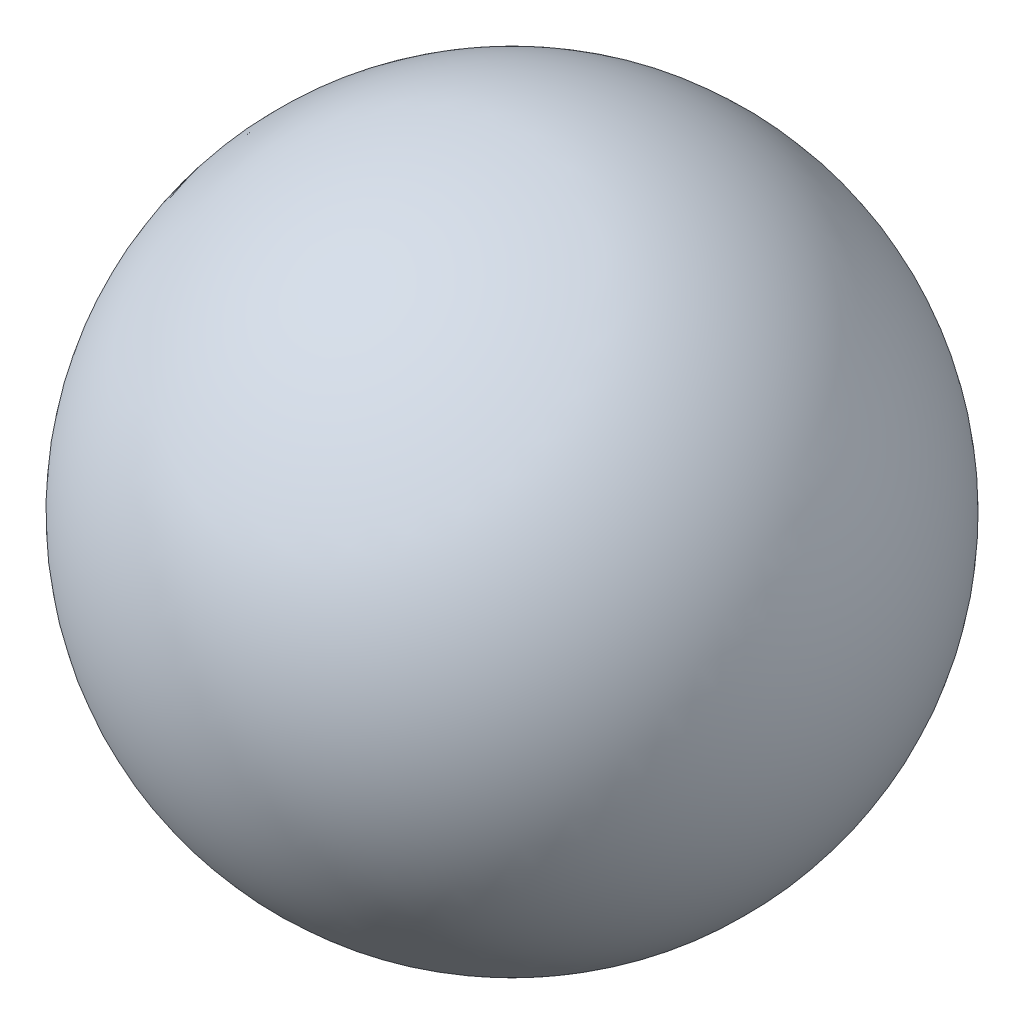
ISO-10303-21;
HEADER;
FILE_DESCRIPTION(('STEP AP214'),'2;1');
FILE_NAME('part.step','',(''),(''),'','','');
FILE_SCHEMA(('AUTOMOTIVE_DESIGN { 1 0 10303 214 1 1 1 1 }'));
ENDSEC;
DATA;
#1=APPLICATION_CONTEXT('core data for automotive mechanical design processes');
#2=APPLICATION_PROTOCOL_DEFINITION('international standard','automotive_design',2000,#1);
#3=PRODUCT_CONTEXT('',#1,'mechanical');
#4=PRODUCT('Part','Part','',(#3));
#5=PRODUCT_RELATED_PRODUCT_CATEGORY('part','',(#4));
#6=PRODUCT_DEFINITION_FORMATION('','',#4);
#7=PRODUCT_DEFINITION_CONTEXT('part definition',#1,'design');
#8=PRODUCT_DEFINITION('design','',#6,#7);
#9=PRODUCT_DEFINITION_SHAPE('','',#8);
#10=(LENGTH_UNIT() NAMED_UNIT(*) SI_UNIT(.MILLI.,.METRE.));
#11=(NAMED_UNIT(*) PLANE_ANGLE_UNIT() SI_UNIT($,.RADIAN.));
#12=(NAMED_UNIT(*) SI_UNIT($,.STERADIAN.) SOLID_ANGLE_UNIT());
#13=UNCERTAINTY_MEASURE_WITH_UNIT(LENGTH_MEASURE(1.E-05),#10,'distance_accuracy_value','');
#14=(GEOMETRIC_REPRESENTATION_CONTEXT(3) GLOBAL_UNCERTAINTY_ASSIGNED_CONTEXT((#13)) GLOBAL_UNIT_ASSIGNED_CONTEXT((#10,
#11,#12)) REPRESENTATION_CONTEXT('',''));
#15=CARTESIAN_POINT('',(0.,0.,0.));
#16=DIRECTION('',(0.,0.,1.));
#17=DIRECTION('',(1.,0.,0.));
#18=AXIS2_PLACEMENT_3D('',#15,#16,#17);
#19=CARTESIAN_POINT('',(6.6,0.,-10.5));
#20=DIRECTION('',(0.241206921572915,0.932245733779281,0.269698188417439));
#21=DIRECTION('',(-0.970471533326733,0.231116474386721,0.0690664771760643));
#22=AXIS2_PLACEMENT_3D('',#19,#20,#21);
#23=SPHERICAL_SURFACE('',#22,2.86);
#24=CARTESIAN_POINT('',(5.91014820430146,-2.66622279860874,-11.2713368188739));
#25=VERTEX_POINT('',#24);
#26=VERTEX_LOOP('',#25);
#27=FACE_BOUND('',#26,.T.);
#28=CARTESIAN_POINT('',(7.28985179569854,2.66622279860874,-9.72866318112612));
#29=VERTEX_POINT('',#28);
#30=VERTEX_LOOP('',#29);
#31=FACE_BOUND('',#30,.T.);
#32=ADVANCED_FACE('F16',(#27,#31),#23,.T.);
#33=CLOSED_SHELL('',(#32));
#34=MANIFOLD_SOLID_BREP('B1',#33);
#35=ADVANCED_BREP_SHAPE_REPRESENTATION('',(#18,#34),#14);
#36=SHAPE_DEFINITION_REPRESENTATION(#9,#35);
ENDSEC;
END-ISO-10303-21;
